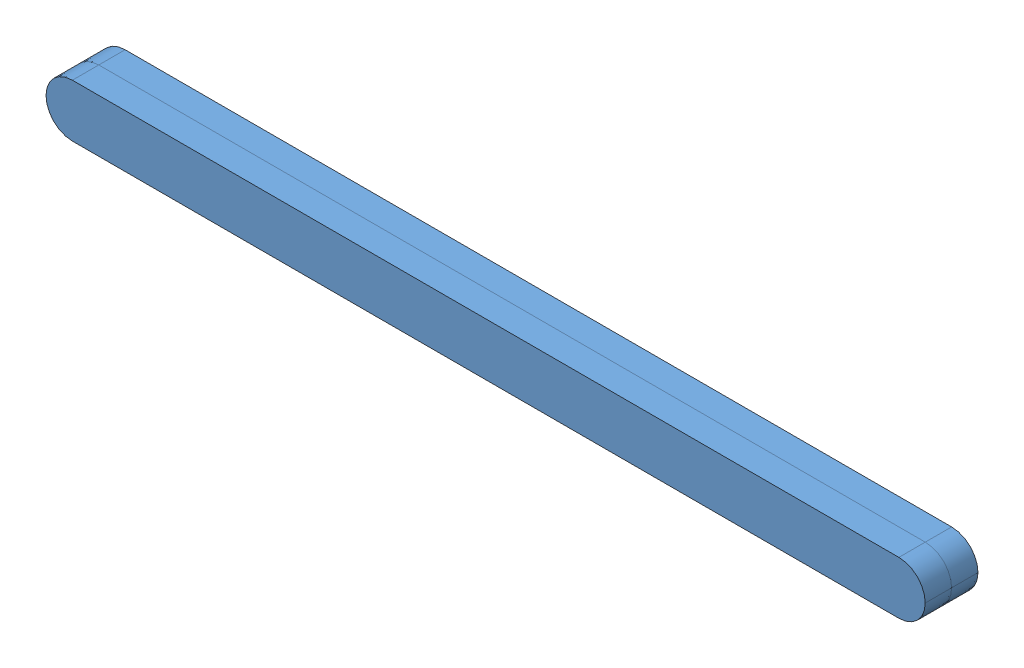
SolidWorks assembly bimetal.SLDASM, configuration Default (file format 3400). Lengths in mm.
Overall size (100 6 6).
2 component instances, 1 part files, 3 mates.
Components (placement in the parent):
- bimetal-5: bimetal.SLDPRT [Default] at origin size (100 6 3)
- bimetal-6: bimetal.SLDPRT [Default] at (0 0 3) size (100 6 3)
Mates (geometry in assembly coordinates):
- Coincident6: coincident anti-aligned: plane of bimetal-5 through (0 6 3) normal (0 0 1); plane of bimetal-6 through (0 6 3) normal (0 0 -1)
- Coincident7: coincident aligned: plane of bimetal-5 through (0 6 3) normal (0 1 0); plane of bimetal-6 through (0 6 6) normal (0 1 0)
- Concentric2: concentric aligned: cylinder of bimetal-5; cylinder of bimetal-6
